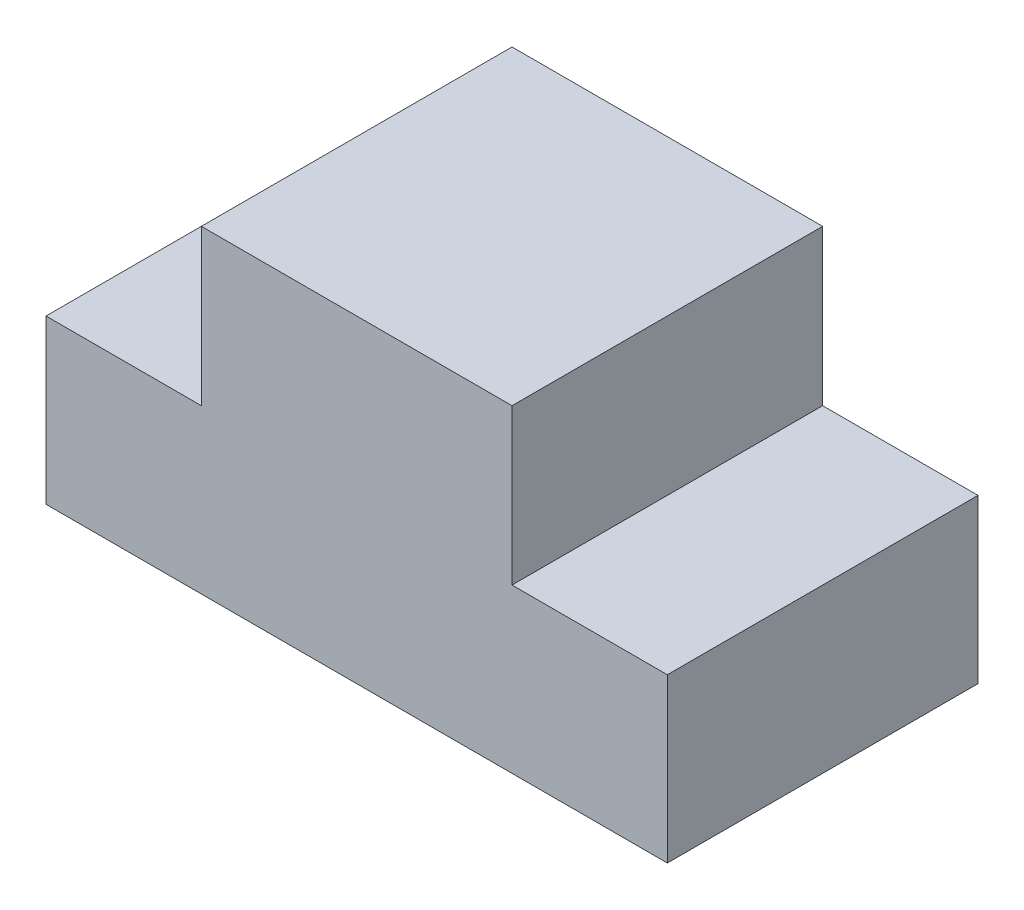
from build123d import *

# Parameters (mm, degrees)
SKETCH1_W      = 152.4
SKETCH1_H      = 40
EXTRUDE1_DEPTH = 38.1
SKETCH3_W      = 76.2
SKETCH3_H      = 76.2
EXTRUDE2_DEPTH = 38.1


with BuildPart() as part:
    # Sketch1 → Extrude1 (new, symmetric)
    with BuildSketch(Plane.XY):
        with Locations((0, 20)):
            Rectangle(SKETCH1_W, SKETCH1_H)
    extrude(amount=EXTRUDE1_DEPTH, both=True)

    # Sketch3 → Extrude2 (add)
    with BuildSketch(Plane(origin=(0, 40, 0), x_dir=(-1, 0, 0), z_dir=(0, 1, 0))):
        Rectangle(SKETCH3_W, SKETCH3_H)
    extrude(amount=EXTRUDE2_DEPTH)


solid = part.part
